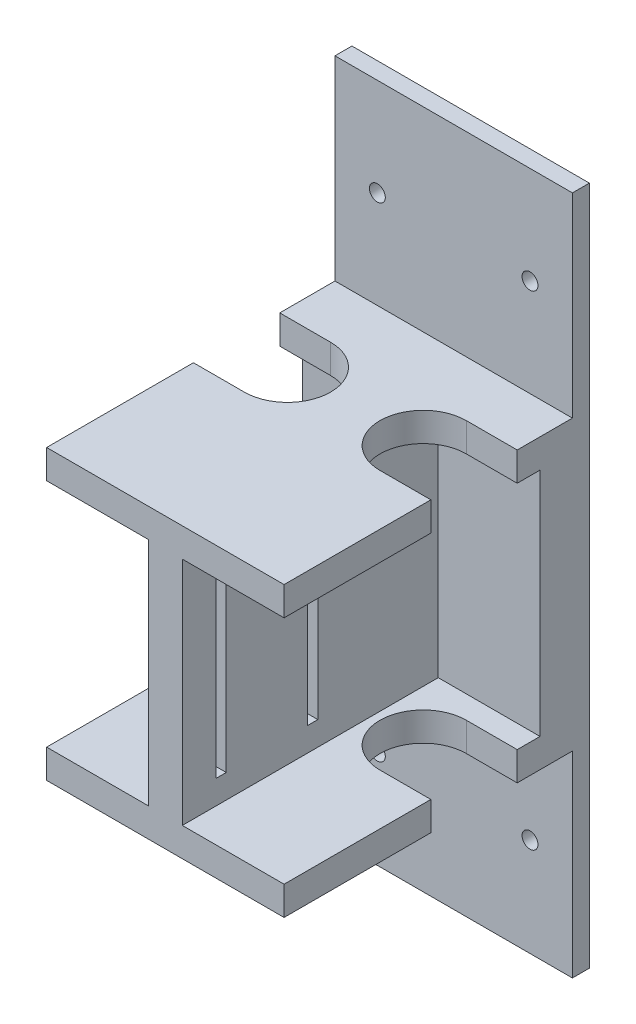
from build123d import *

# Parameters (mm, degrees)
SKETCH1_W                = 35.56
SKETCH1_H                = 43.18
BOSS_EXTRUDE1_DEPTH      = 45.72
SKETCH2_W                = 38.3286
SKETCH2_H                = 34.544
CUT_EXTRUDE1_DEPTH       = 15.24
SKETCH4_W                = 38.3286
SKETCH4_H                = 34.544
CUT_EXTRUDE2_DEPTH       = 15.24
CUT_EXTRUDE6_DEPTH       = 66.352576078
BOSS_EXTRUDE2_DEPTH      = 29.21
BOSS_EXTRUDE2_DEPTH_BACK = 72.6186
SKETCH7_W                = 35.56
SKETCH7_H                = 2.54
SKETCH12_R               = 1.190625
CUT_EXTRUDE7_DEPTH       = 70.170505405
SKETCH16_R               = 1.190625
CUT_EXTRUDE8_DEPTH       = 70.170505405
SKETCH18_W               = 1.524
SKETCH18_H               = 27.3812
CUT_EXTRUDE9_DEPTH       = 1.524
SKETCH19_W               = 1.524
SKETCH19_H               = 27.3812
CUT_EXTRUDE10_DEPTH      = 1.524


with BuildPart() as part:
    # Sketch1 → Boss-Extrude1 (new body)
    with BuildSketch(Plane.XY):
        Rectangle(SKETCH1_W, SKETCH1_H)
    extrude(amount=BOSS_EXTRUDE1_DEPTH)

    # Sketch2 → Cut-Extrude1 (cut)
    with BuildSketch(Plane(origin=(17.78, 0, 0), x_dir=(0, 0, -1), z_dir=(1, 0, 0))):
        with Locations((-26.5557, 0)):
            Rectangle(SKETCH2_W, SKETCH2_H)
    extrude(amount=-CUT_EXTRUDE1_DEPTH, mode=Mode.SUBTRACT)

    # Sketch4 → Cut-Extrude2 (cut)
    with BuildSketch(Plane.ZY.offset(17.78)):
        with Locations((26.5557, 0)):
            Rectangle(SKETCH4_W, SKETCH4_H)
    extrude(amount=-CUT_EXTRUDE2_DEPTH, mode=Mode.SUBTRACT)

    # Sketch5 → Cut-Extrude6 (cut, through all)
    with BuildSketch(Plane(origin=(0, 21.59, 0), x_dir=(1, 0, 0), z_dir=(0, 1, 0))):
        with BuildLine():
            Line((-10.16, -10.8077), (-17.78, -10.8077))
            Line((-17.78, -10.8077), (-17.78, -23.7363))
            Line((-17.78, -23.7363), (-10.16, -23.7363))
            ThreePointArc((-10.16, -23.7363), (-16.6243, -17.272), (-10.16, -10.8077))
        make_face()
        with BuildLine():
            ThreePointArc((-3.6957, -17.272), (-5.589049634, -12.701049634), (-10.16, -10.8077))
            Line((-10.16, -10.8077), (-10.16, -23.7363))
            ThreePointArc((-10.16, -23.7363), (-5.589049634, -21.842950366), (-3.6957, -17.272))
        make_face()
        with BuildLine():
            Line((-10.16, -23.7363), (-10.16, -10.8077))
            ThreePointArc((-10.16, -10.8077), (-16.6243, -17.272), (-10.16, -23.7363))
        make_face()
        with BuildLine():
            ThreePointArc((-3.6957, -17.272), (-5.589049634, -12.701049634), (-10.16, -10.8077))
            Line((-10.16, -10.8077), (-10.16, -23.7363))
            ThreePointArc((-10.16, -23.7363), (-5.589049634, -21.842950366), (-3.6957, -17.272))
        make_face()
        with BuildLine():
            Line((-10.16, -23.7363), (-10.16, -10.8077))
            ThreePointArc((-10.16, -10.8077), (-16.6243, -17.272), (-10.16, -23.7363))
        make_face()
        with BuildLine():
            ThreePointArc((16.6243, -17.272), (14.730950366, -12.701049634), (10.16, -10.8077))
            Line((10.16, -10.8077), (10.16, -23.7363))
            ThreePointArc((10.16, -23.7363), (14.730950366, -21.842950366), (16.6243, -17.272))
        make_face()
        with BuildLine():
            Line((10.16, -23.7363), (10.16, -10.8077))
            ThreePointArc((10.16, -10.8077), (3.6957, -17.272), (10.16, -23.7363))
        make_face()
        with BuildLine():
            ThreePointArc((16.6243, -17.272), (14.730950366, -12.701049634), (10.16, -10.8077))
            Line((10.16, -10.8077), (10.16, -23.7363))
            ThreePointArc((10.16, -23.7363), (14.730950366, -21.842950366), (16.6243, -17.272))
        make_face()
        with BuildLine():
            Line((10.16, -23.7363), (10.16, -10.8077))
            ThreePointArc((10.16, -10.8077), (3.6957, -17.272), (10.16, -23.7363))
        make_face()
        with BuildLine():
            Line((17.78, -10.8077), (10.16, -10.8077))
            ThreePointArc((10.16, -10.8077), (14.730950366, -12.701049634), (16.6243, -17.272))
            ThreePointArc((16.6243, -17.272), (14.730950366, -21.842950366), (10.16, -23.7363))
            Line((10.16, -23.7363), (17.78, -23.7363))
            Line((17.78, -23.7363), (17.78, -10.8077))
        make_face()
    extrude(amount=-CUT_EXTRUDE6_DEPTH, mode=Mode.SUBTRACT)

    # Sketch7 → Boss-Extrude2 (add, two sides: drawn at the far end of the back side and taken through both)
    with BuildSketch(Plane(origin=(0, 21.59, 0), x_dir=(1, 0, 0), z_dir=(0, 1, 0)).offset(-BOSS_EXTRUDE2_DEPTH_BACK)):
        with Locations((0, -1.27)):
            Rectangle(SKETCH7_W, SKETCH7_H)
    extrude(amount=BOSS_EXTRUDE2_DEPTH + BOSS_EXTRUDE2_DEPTH_BACK)

    # Sketch12 → Cut-Extrude7 (cut, through all)
    with BuildSketch(Plane.XY.offset(2.54)):
        with Locations((-11.43, 36.195)):
            Circle(SKETCH12_R)
        with Locations((11.43, 36.195)):
            Circle(SKETCH12_R)
    extrude(amount=-CUT_EXTRUDE7_DEPTH, mode=Mode.SUBTRACT)

    # Sketch16 → Cut-Extrude8 (cut, through all)
    with BuildSketch(Plane.XY.offset(2.54)):
        with Locations((-11.43, -36.3093)):
            Circle(SKETCH16_R)
        with Locations((11.43, -36.3093)):
            Circle(SKETCH16_R)
    extrude(amount=-CUT_EXTRUDE8_DEPTH, mode=Mode.SUBTRACT)

    # Sketch18 → Cut-Extrude9 (cut)
    with BuildSketch(Plane.ZY.offset(2.54)):
        with Locations((26.1874, 0)):
            Rectangle(SKETCH18_W, SKETCH18_H)
        with Locations((33.4264, 0)):
            Rectangle(SKETCH18_W, SKETCH18_H)
        with Locations((40.3606, 0)):
            Rectangle(SKETCH18_W, SKETCH18_H)
    extrude(amount=-CUT_EXTRUDE9_DEPTH, mode=Mode.SUBTRACT)

    # Sketch19 → Cut-Extrude10 (cut)
    with BuildSketch(Plane(origin=(2.54, 0, 0), x_dir=(0, 0, -1), z_dir=(1, 0, 0))):
        with Locations((-26.1874, 0)):
            Rectangle(SKETCH19_W, SKETCH19_H)
        with Locations((-39.9034, 0)):
            Rectangle(SKETCH19_W, SKETCH19_H)
    extrude(amount=-CUT_EXTRUDE10_DEPTH, mode=Mode.SUBTRACT)


solid = part.part
